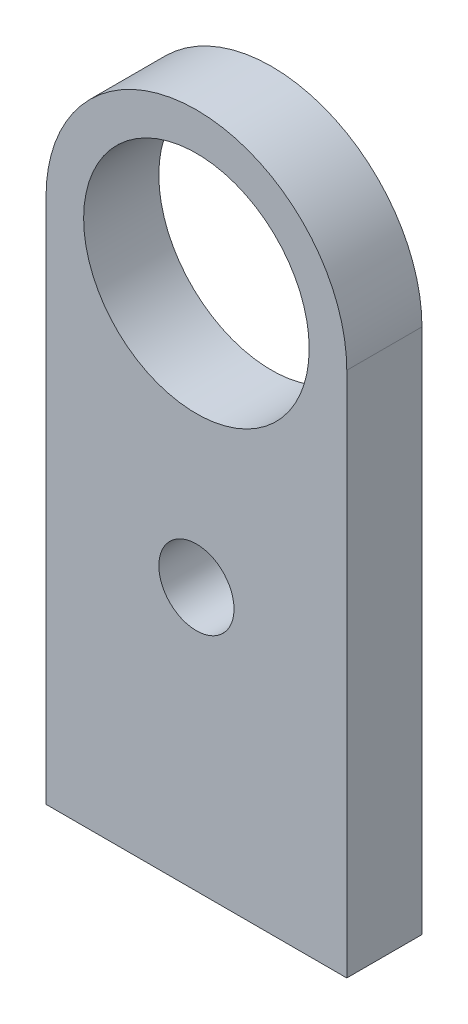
from build123d import *

# Parameters (mm, degrees)
SKETCH2_R           = 9.525
SKETCH2_R_2         = 3.175
BOSS_EXTRUDE1_DEPTH = 6.35


with BuildPart() as part:
    # Sketch2 → Boss-Extrude1 (new body)
    with BuildSketch(Plane.XY):
        with BuildLine():
            Line((-12.7, -44.45), (-12.7, 0))
            ThreePointArc((-12.7, 0), (0, 12.7), (12.7, 0))
            Line((12.7, 0), (12.7, -44.45))
            Line((12.7, -44.45), (-12.7, -44.45))
        make_face()
        Circle(SKETCH2_R, mode=Mode.SUBTRACT)
        with Locations((0, -22.225)):
            Circle(SKETCH2_R_2, mode=Mode.SUBTRACT)
    extrude(amount=BOSS_EXTRUDE1_DEPTH)


solid = part.part
